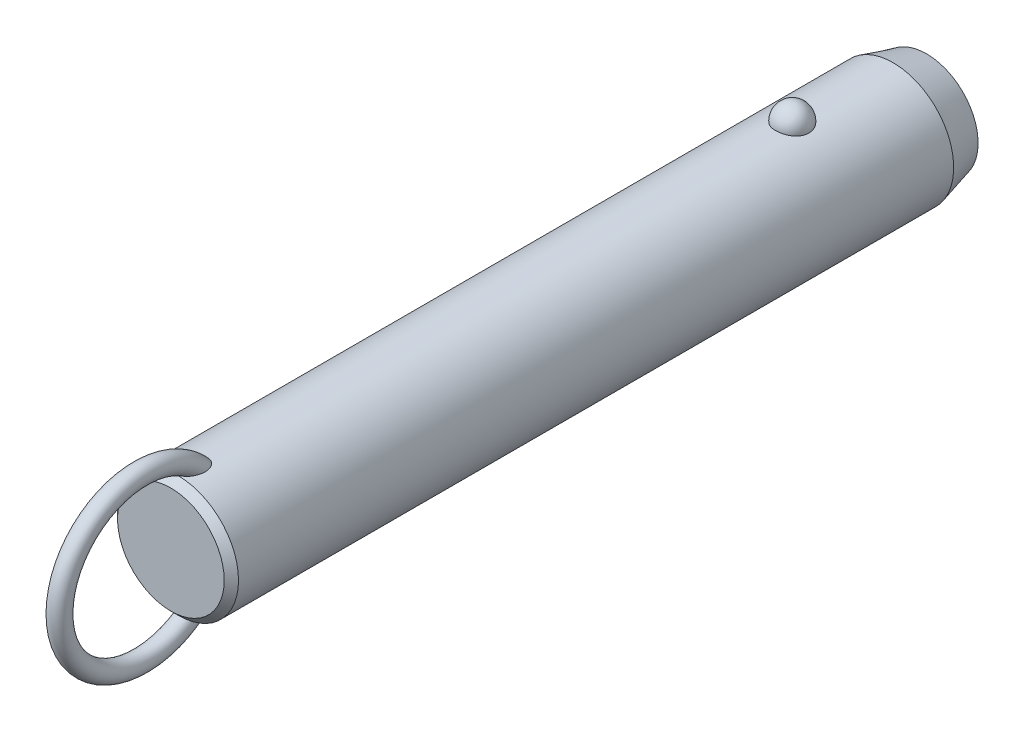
ISO-10303-21;
HEADER;
FILE_DESCRIPTION(('STEP AP214'),'2;1');
FILE_NAME('part.step','',(''),(''),'','','');
FILE_SCHEMA(('AUTOMOTIVE_DESIGN { 1 0 10303 214 1 1 1 1 }'));
ENDSEC;
DATA;
#1=APPLICATION_CONTEXT('core data for automotive mechanical design processes');
#2=APPLICATION_PROTOCOL_DEFINITION('international standard','automotive_design',2000,#1);
#3=PRODUCT_CONTEXT('',#1,'mechanical');
#4=PRODUCT('Part','Part','',(#3));
#5=PRODUCT_RELATED_PRODUCT_CATEGORY('part','',(#4));
#6=PRODUCT_DEFINITION_FORMATION('','',#4);
#7=PRODUCT_DEFINITION_CONTEXT('part definition',#1,'design');
#8=PRODUCT_DEFINITION('design','',#6,#7);
#9=PRODUCT_DEFINITION_SHAPE('','',#8);
#10=(LENGTH_UNIT() NAMED_UNIT(*) SI_UNIT(.MILLI.,.METRE.));
#11=(NAMED_UNIT(*) PLANE_ANGLE_UNIT() SI_UNIT($,.RADIAN.));
#12=(NAMED_UNIT(*) SI_UNIT($,.STERADIAN.) SOLID_ANGLE_UNIT());
#13=UNCERTAINTY_MEASURE_WITH_UNIT(LENGTH_MEASURE(1.E-05),#10,'distance_accuracy_value','');
#14=(GEOMETRIC_REPRESENTATION_CONTEXT(3) GLOBAL_UNCERTAINTY_ASSIGNED_CONTEXT((#13)) GLOBAL_UNIT_ASSIGNED_CONTEXT((#10,
#11,#12)) REPRESENTATION_CONTEXT('',''));
#15=CARTESIAN_POINT('',(0.,0.,0.));
#16=DIRECTION('',(0.,0.,1.));
#17=DIRECTION('',(1.,0.,0.));
#18=AXIS2_PLACEMENT_3D('',#15,#16,#17);
#19=CARTESIAN_POINT('',(0.,0.,114.3));
#20=DIRECTION('',(0.,0.,-1.));
#21=DIRECTION('',(-1.,0.,0.));
#22=AXIS2_PLACEMENT_3D('',#19,#20,#21);
#23=CYLINDRICAL_SURFACE('',#22,12.7);
#24=CARTESIAN_POINT('',(3.46661256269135,12.2177165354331,-3.5));
#25=CARTESIAN_POINT('',(3.4666090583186,12.2177194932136,-3.30432790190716));
#26=CARTESIAN_POINT('',(3.45063567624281,12.2222841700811,-3.10861112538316));
#27=CARTESIAN_POINT('',(3.38712451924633,12.2400345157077,-2.72271899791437));
#28=CARTESIAN_POINT('',(3.33957415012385,12.2532236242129,-2.53254588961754));
#29=CARTESIAN_POINT('',(3.2141234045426,12.286724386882,-2.16324948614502));
#30=CARTESIAN_POINT('',(3.13623639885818,12.3070329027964,-1.98412136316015));
#31=CARTESIAN_POINT('',(2.95205930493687,12.3525018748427,-1.64180592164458));
#32=CARTESIAN_POINT('',(2.84577003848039,12.3776621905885,-1.47861814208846));
#33=CARTESIAN_POINT('',(2.60688050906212,12.4301712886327,-1.17190583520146));
#34=CARTESIAN_POINT('',(2.47415697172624,12.4575299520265,-1.02847897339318));
#35=CARTESIAN_POINT('',(2.18615174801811,12.5112810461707,-0.766177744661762));
#36=CARTESIAN_POINT('',(2.03087002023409,12.5376734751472,-0.64730342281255));
#37=CARTESIAN_POINT('',(1.70237334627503,12.5864761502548,-0.437732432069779));
#38=CARTESIAN_POINT('',(1.52920948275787,12.6088972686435,-0.346958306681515));
#39=CARTESIAN_POINT('',(1.16944170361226,12.6473352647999,-0.195750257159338));
#40=CARTESIAN_POINT('',(0.982839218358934,12.663352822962,-0.135313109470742));
#41=CARTESIAN_POINT('',(0.604961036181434,12.6869706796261,-0.0473241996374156));
#42=CARTESIAN_POINT('',(0.41382314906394,12.6947125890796,-0.0192185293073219));
#43=CARTESIAN_POINT('',(0.0293827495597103,12.7014203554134,0.0051725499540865));
#44=CARTESIAN_POINT('',(-0.163919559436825,12.7003870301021,0.00146092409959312));
#45=CARTESIAN_POINT('',(-0.544374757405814,12.689735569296,-0.0373939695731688));
#46=CARTESIAN_POINT('',(-0.731575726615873,12.6802364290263,-0.0721015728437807));
#47=CARTESIAN_POINT('',(-1.09733277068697,12.6538333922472,-0.171364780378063));
#48=CARTESIAN_POINT('',(-1.27588869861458,12.6369293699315,-0.235920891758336));
#49=CARTESIAN_POINT('',(-1.6204698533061,12.5973946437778,-0.393548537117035));
#50=CARTESIAN_POINT('',(-1.78641865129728,12.5747321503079,-0.486778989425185));
#51=CARTESIAN_POINT('',(-2.10030671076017,12.5261316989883,-0.699110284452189));
#52=CARTESIAN_POINT('',(-2.24824419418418,12.5001934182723,-0.818213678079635));
#53=CARTESIAN_POINT('',(-2.52491489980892,12.4472906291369,-1.08157124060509));
#54=CARTESIAN_POINT('',(-2.65324222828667,12.4203160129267,-1.22624992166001));
#55=CARTESIAN_POINT('',(-2.88410007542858,12.3687509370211,-1.53528325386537));
#56=CARTESIAN_POINT('',(-2.98662883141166,12.3441606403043,-1.69963924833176));
#57=CARTESIAN_POINT('',(-3.16432417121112,12.2998199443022,-2.04548497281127));
#58=CARTESIAN_POINT('',(-3.23917525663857,12.2801261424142,-2.22714424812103));
#59=CARTESIAN_POINT('',(-3.35800573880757,12.248167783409,-2.6009138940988));
#60=CARTESIAN_POINT('',(-3.4019860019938,12.2359030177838,-2.79302397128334));
#61=CARTESIAN_POINT('',(-3.45784812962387,12.2202347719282,-3.18140279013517));
#62=CARTESIAN_POINT('',(-3.46986123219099,12.2167950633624,-3.37765118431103));
#63=CARTESIAN_POINT('',(-3.46186273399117,12.2190638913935,-3.76943689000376));
#64=CARTESIAN_POINT('',(-3.44185196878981,12.2247721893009,-3.96497421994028));
#65=CARTESIAN_POINT('',(-3.37048652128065,12.2446381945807,-4.34881728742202));
#66=CARTESIAN_POINT('',(-3.31928253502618,12.2587552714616,-4.53715319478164));
#67=CARTESIAN_POINT('',(-3.18693461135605,12.2938237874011,-4.90231727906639));
#68=CARTESIAN_POINT('',(-3.1057895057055,12.3147754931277,-5.07914500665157));
#69=CARTESIAN_POINT('',(-2.91506431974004,12.3613125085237,-5.41732059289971));
#70=CARTESIAN_POINT('',(-2.80533587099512,12.3869217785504,-5.57858147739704));
#71=CARTESIAN_POINT('',(-2.560414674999,12.4398525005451,-5.88013283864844));
#72=CARTESIAN_POINT('',(-2.42522099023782,12.4671740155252,-6.02042254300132));
#73=CARTESIAN_POINT('',(-2.1323357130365,12.5205965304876,-6.27662798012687));
#74=CARTESIAN_POINT('',(-1.97456596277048,12.5466928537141,-6.3924554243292));
#75=CARTESIAN_POINT('',(-1.64115839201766,12.5946384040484,-6.59583547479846));
#76=CARTESIAN_POINT('',(-1.46552179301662,12.6164879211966,-6.68339001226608));
#77=CARTESIAN_POINT('',(-1.10356050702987,12.6532533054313,-6.82682153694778));
#78=CARTESIAN_POINT('',(-0.9173913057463,12.6682500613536,-6.8830698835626));
#79=CARTESIAN_POINT('',(-0.537836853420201,12.6900288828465,-6.96386887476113));
#80=CARTESIAN_POINT('',(-0.344452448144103,12.6968119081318,-6.9884232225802));
#81=CARTESIAN_POINT('',(0.0402577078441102,12.7013667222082,-7.00496469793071));
#82=CARTESIAN_POINT('',(0.231556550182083,12.6993008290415,-6.99753844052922));
#83=CARTESIAN_POINT('',(0.610105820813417,12.6867505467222,-6.9516636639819));
#84=CARTESIAN_POINT('',(0.797356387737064,12.6762664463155,-6.913216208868));
#85=CARTESIAN_POINT('',(1.16186657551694,12.6480587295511,-6.80658431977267));
#86=CARTESIAN_POINT('',(1.33915951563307,12.6303611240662,-6.73850666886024));
#87=CARTESIAN_POINT('',(1.67968518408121,12.5896027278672,-6.5745087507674));
#88=CARTESIAN_POINT('',(1.84291705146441,12.5665416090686,-6.47858678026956));
#89=CARTESIAN_POINT('',(2.15340192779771,12.5171072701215,-6.25982455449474));
#90=CARTESIAN_POINT('',(2.30037831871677,12.4906895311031,-6.13660186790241));
#91=CARTESIAN_POINT('',(2.5717412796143,12.4376567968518,-5.86739587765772));
#92=CARTESIAN_POINT('',(2.69612388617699,12.4110417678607,-5.72140858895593));
#93=CARTESIAN_POINT('',(2.92107785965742,12.360051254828,-5.40794137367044));
#94=CARTESIAN_POINT('',(3.02121329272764,12.3357209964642,-5.24014110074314));
#95=CARTESIAN_POINT('',(3.19236291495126,12.2925446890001,-4.88969865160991));
#96=CARTESIAN_POINT('',(3.26338839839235,12.2736965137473,-4.70706226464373));
#97=CARTESIAN_POINT('',(3.36788038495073,12.245404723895,-4.35469510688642));
#98=CARTESIAN_POINT('',(3.40484026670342,12.2351018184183,-4.18605935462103));
#99=CARTESIAN_POINT('',(3.45420764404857,12.2212564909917,-3.84496058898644));
#100=CARTESIAN_POINT('',(3.46661565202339,12.2177139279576,-3.67249765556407));
#101=CARTESIAN_POINT('',(3.46661256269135,12.2177165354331,-3.5));
#102=B_SPLINE_CURVE_WITH_KNOTS('',3,(#24,#25,#26,#27,#28,#29,#30,#31,#32,#33,#34,#35,#36,#37,
#38,#39,#40,#41,#42,#43,#44,#45,#46,#47,#48,#49,#50,#51,#52,#53,#54,#55,#56,#57,#58,#59,#60,#61,
#62,#63,#64,#65,#66,#67,#68,#69,#70,#71,#72,#73,#74,#75,#76,#77,#78,#79,#80,#81,#82,#83,#84,#85,
#86,#87,#88,#89,#90,#91,#92,#93,#94,#95,#96,#97,#98,#99,#100,#101),.UNSPECIFIED.,.T.,.F.,(4,2,2,
2,2,2,2,2,2,2,2,2,2,2,2,2,2,2,2,2,2,2,2,2,2,2,2,2,2,2,2,2,2,2,2,2,2,2,4),(0.,0.586396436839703,
1.17302689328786,1.7593990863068,2.34575431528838,2.93491084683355,3.52406845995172,
4.11158733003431,4.69904375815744,5.2762784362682,5.85345931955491,6.42265312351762,
6.99185659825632,7.56427334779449,8.136746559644,8.71981013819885,9.3029135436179,
9.89247258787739,10.4820150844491,11.0691335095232,11.6562366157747,12.2405256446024,
12.8248374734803,13.412244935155,13.9996740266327,14.5891883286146,15.1786623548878,
15.7609861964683,16.3432419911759,16.9148635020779,17.4864654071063,18.0560241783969,
18.6256177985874,19.2037609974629,19.7820055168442,20.3699810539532,20.957728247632,
21.4746855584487,21.9916320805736),.UNSPECIFIED.);
#103=CARTESIAN_POINT('',(3.46661256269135,12.2177165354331,-3.5));
#104=VERTEX_POINT('',#103);
#105=EDGE_CURVE('E41',#104,#104,#102,.T.);
#106=ORIENTED_EDGE('',*,*,#105,.T.);
#107=EDGE_LOOP('',(#106));
#108=FACE_BOUND('',#107,.T.);
#109=CARTESIAN_POINT('',(0.,0.,125.5));
#110=DIRECTION('',(0.,0.,1.));
#111=DIRECTION('',(1.,0.,0.));
#112=AXIS2_PLACEMENT_3D('',#109,#110,#111);
#113=CIRCLE('',#112,12.7);
#114=CARTESIAN_POINT('',(12.7,0.,125.5));
#115=VERTEX_POINT('',#114);
#116=EDGE_CURVE('E10',#115,#115,#113,.F.);
#117=ORIENTED_EDGE('',*,*,#116,.T.);
#118=EDGE_LOOP('',(#117));
#119=FACE_BOUND('',#118,.T.);
#120=CARTESIAN_POINT('',(-0.548122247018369,-12.6881662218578,119.243218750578));
#121=CARTESIAN_POINT('',(-0.648865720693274,-12.6838128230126,119.277926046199));
#122=CARTESIAN_POINT('',(-0.746398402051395,-12.6783867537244,119.322042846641));
#123=CARTESIAN_POINT('',(-0.932125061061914,-12.666091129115,119.426764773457));
#124=CARTESIAN_POINT('',(-1.02030388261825,-12.6592192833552,119.487396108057));
#125=CARTESIAN_POINT('',(-1.18487740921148,-12.6448747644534,119.621847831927));
#126=CARTESIAN_POINT('',(-1.26134296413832,-12.637406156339,119.695582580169));
#127=CARTESIAN_POINT('',(-1.40231200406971,-12.6225412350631,119.853604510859));
#128=CARTESIAN_POINT('',(-1.46681470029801,-12.6151449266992,119.93789238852));
#129=CARTESIAN_POINT('',(-1.60714786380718,-12.5981718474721,120.149657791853));
#130=CARTESIAN_POINT('',(-1.67725126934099,-12.588900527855,120.280962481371));
#131=CARTESIAN_POINT('',(-1.79536591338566,-12.5725964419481,120.553247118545));
#132=CARTESIAN_POINT('',(-1.84333535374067,-12.5655679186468,120.694244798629));
#133=CARTESIAN_POINT('',(-1.93422576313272,-12.5519624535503,121.037645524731));
#134=CARTESIAN_POINT('',(-1.96788773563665,-12.5466298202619,121.242557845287));
#135=CARTESIAN_POINT('',(-1.9941399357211,-12.542463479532,121.551760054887));
#136=CARTESIAN_POINT('',(-1.99883864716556,-12.5417153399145,121.655298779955));
#137=CARTESIAN_POINT('',(-2.00078003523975,-12.5414074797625,121.86245124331));
#138=CARTESIAN_POINT('',(-1.99802449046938,-12.5418474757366,121.966064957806));
#139=CARTESIAN_POINT('',(-1.98336733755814,-12.5441750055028,122.210320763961));
#140=CARTESIAN_POINT('',(-1.96851430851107,-12.5465291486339,122.350780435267));
#141=CARTESIAN_POINT('',(-1.92707089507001,-12.5529612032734,122.629960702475));
#142=CARTESIAN_POINT('',(-1.90047458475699,-12.5570399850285,122.768680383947));
#143=CARTESIAN_POINT('',(-1.8361912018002,-12.5666008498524,123.04341135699));
#144=CARTESIAN_POINT('',(-1.79850828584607,-12.57208240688,123.179423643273));
#145=CARTESIAN_POINT('',(-1.71223796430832,-12.5841228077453,123.447842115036));
#146=CARTESIAN_POINT('',(-1.66365679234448,-12.5906810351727,123.580250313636));
#147=CARTESIAN_POINT('',(-1.5780450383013,-12.6016176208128,123.78548877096));
#148=CARTESIAN_POINT('',(-1.54477252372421,-12.6057501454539,123.859914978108));
#149=CARTESIAN_POINT('',(-1.47424480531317,-12.6141930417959,124.006839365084));
#150=CARTESIAN_POINT('',(-1.43699041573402,-12.6185033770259,124.079337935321));
#151=CARTESIAN_POINT('',(-1.35825795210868,-12.6272207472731,124.221892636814));
#152=CARTESIAN_POINT('',(-1.31678520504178,-12.6316276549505,124.291951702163));
#153=CARTESIAN_POINT('',(-1.22917793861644,-12.6404532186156,124.429070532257));
#154=CARTESIAN_POINT('',(-1.18304514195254,-12.6448718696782,124.496131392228));
#155=CARTESIAN_POINT('',(-1.07246411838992,-12.6547893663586,124.643874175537));
#156=CARTESIAN_POINT('',(-1.00642239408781,-12.6602600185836,124.723384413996));
#157=CARTESIAN_POINT('',(-0.864441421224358,-12.6707460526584,124.873169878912));
#158=CARTESIAN_POINT('',(-0.788516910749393,-12.6757620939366,124.943458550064));
#159=CARTESIAN_POINT('',(-0.652215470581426,-12.6833591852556,125.048680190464));
#160=CARTESIAN_POINT('',(-0.594982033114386,-12.6861973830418,125.087624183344));
#161=CARTESIAN_POINT('',(-0.475269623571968,-12.6912445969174,125.156489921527));
#162=CARTESIAN_POINT('',(-0.412800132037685,-12.6934547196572,125.186427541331));
#163=CARTESIAN_POINT('',(-0.295749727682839,-12.6966636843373,125.229756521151));
#164=CARTESIAN_POINT('',(-0.24194995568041,-12.6978134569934,125.245218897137));
#165=CARTESIAN_POINT('',(-0.132508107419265,-12.6994261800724,125.266884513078));
#166=CARTESIAN_POINT('',(-0.0768679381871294,-12.6998898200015,125.273097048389));
#167=CARTESIAN_POINT('',(0.0347696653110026,-12.7000752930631,125.275583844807));
#168=CARTESIAN_POINT('',(0.0907676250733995,-12.6997954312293,125.271835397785));
#169=CARTESIAN_POINT('',(0.201283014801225,-12.6985255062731,125.254788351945));
#170=CARTESIAN_POINT('',(0.255799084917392,-12.6975348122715,125.241481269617));
#171=CARTESIAN_POINT('',(0.37604233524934,-12.6946091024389,125.20203792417));
#172=CARTESIAN_POINT('',(0.440950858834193,-12.6924943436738,125.173449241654));
#173=CARTESIAN_POINT('',(0.565350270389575,-12.6875639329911,125.106323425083));
#174=CARTESIAN_POINT('',(0.624828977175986,-12.6847467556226,125.067764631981));
#175=CARTESIAN_POINT('',(0.774116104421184,-12.6767252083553,124.956949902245));
#176=CARTESIAN_POINT('',(0.859449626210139,-12.6711344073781,124.878760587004));
#177=CARTESIAN_POINT('',(1.01789440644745,-12.6593922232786,124.710943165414));
#178=CARTESIAN_POINT('',(1.09096902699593,-12.653239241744,124.621282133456));
#179=CARTESIAN_POINT('',(1.22268793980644,-12.6411674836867,124.440265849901));
#180=CARTESIAN_POINT('',(1.28193986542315,-12.6352572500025,124.349345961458));
#181=CARTESIAN_POINT('',(1.39259777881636,-12.6235401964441,124.162792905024));
#182=CARTESIAN_POINT('',(1.44399707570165,-12.6177334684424,124.067155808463));
#183=CARTESIAN_POINT('',(1.53972870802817,-12.6064093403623,123.872273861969));
#184=CARTESIAN_POINT('',(1.58405262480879,-12.6008922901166,123.773024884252));
#185=CARTESIAN_POINT('',(1.66600705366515,-12.5903187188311,123.571772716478));
#186=CARTESIAN_POINT('',(1.70363651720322,-12.5852622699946,123.469769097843));
#187=CARTESIAN_POINT('',(1.7754537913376,-12.5753406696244,123.254358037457));
#188=CARTESIAN_POINT('',(1.80903453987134,-12.5705328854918,123.140745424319));
#189=CARTESIAN_POINT('',(1.86844163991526,-12.5618400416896,122.911457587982));
#190=CARTESIAN_POINT('',(1.89426665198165,-12.5579551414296,122.795782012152));
#191=CARTESIAN_POINT('',(1.93785464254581,-12.5513030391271,122.563007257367));
#192=CARTESIAN_POINT('',(1.95562640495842,-12.5485346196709,122.445909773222));
#193=CARTESIAN_POINT('',(1.98264463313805,-12.5442934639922,122.210747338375));
#194=CARTESIAN_POINT('',(1.99189298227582,-12.5428204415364,122.09268260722));
#195=CARTESIAN_POINT('',(2.00416068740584,-12.540871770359,121.780622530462));
#196=CARTESIAN_POINT('',(1.99944433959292,-12.541631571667,121.586229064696));
#197=CARTESIAN_POINT('',(1.9611375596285,-12.5476846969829,121.200309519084));
#198=CARTESIAN_POINT('',(1.92758341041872,-12.5529723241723,121.008780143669));
#199=CARTESIAN_POINT('',(1.83934342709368,-12.5661532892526,120.682272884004));
#200=CARTESIAN_POINT('',(1.79215440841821,-12.5730485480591,120.54524997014));
#201=CARTESIAN_POINT('',(1.67676242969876,-12.588958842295,120.280445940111));
#202=CARTESIAN_POINT('',(1.60859050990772,-12.597970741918,120.152651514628));
#203=CARTESIAN_POINT('',(1.46583832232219,-12.6152829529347,119.935800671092));
#204=CARTESIAN_POINT('',(1.39525727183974,-12.6233659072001,119.84410500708));
#205=CARTESIAN_POINT('',(1.23992594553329,-12.6395676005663,119.673485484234));
#206=CARTESIAN_POINT('',(1.15517932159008,-12.6476863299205,119.594558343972));
#207=CARTESIAN_POINT('',(0.971995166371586,-12.6630846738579,119.452643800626));
#208=CARTESIAN_POINT('',(0.873456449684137,-12.6703572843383,119.389784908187));
#209=CARTESIAN_POINT('',(0.665847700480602,-12.6829569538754,119.284487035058));
#210=CARTESIAN_POINT('',(0.556784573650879,-12.688285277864,119.242034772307));
#211=CARTESIAN_POINT('',(0.347338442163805,-12.6956226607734,119.184443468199));
#212=CARTESIAN_POINT('',(0.247759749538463,-12.6979816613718,119.166399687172));
#213=CARTESIAN_POINT('',(0.0470218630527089,-12.7003077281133,119.148600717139));
#214=CARTESIAN_POINT('',(-0.0541350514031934,-12.7002779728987,119.148821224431));
#215=CARTESIAN_POINT('',(-0.221414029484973,-12.6982482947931,119.164363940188));
#216=CARTESIAN_POINT('',(-0.288055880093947,-12.6969033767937,119.174666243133));
#217=CARTESIAN_POINT('',(-0.4195992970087,-12.6932369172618,119.20313489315));
#218=CARTESIAN_POINT('',(-0.48450102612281,-12.6909154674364,119.221300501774));
#219=CARTESIAN_POINT('',(-0.548122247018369,-12.6881662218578,119.243218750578));
#220=B_SPLINE_CURVE_WITH_KNOTS('',3,(#120,#121,#122,#123,#124,#125,#126,#127,#128,#129,#130,
#131,#132,#133,#134,#135,#136,#137,#138,#139,#140,#141,#142,#143,#144,#145,#146,#147,#148,#149,
#150,#151,#152,#153,#154,#155,#156,#157,#158,#159,#160,#161,#162,#163,#164,#165,#166,#167,#168,
#169,#170,#171,#172,#173,#174,#175,#176,#177,#178,#179,#180,#181,#182,#183,#184,#185,#186,#187,
#188,#189,#190,#191,#192,#193,#194,#195,#196,#197,#198,#199,#200,#201,#202,#203,#204,#205,#206,
#207,#208,#209,#210,#211,#212,#213,#214,#215,#216,#217,#218,#219),.UNSPECIFIED.,.T.,.F.,(4,2,2,
2,2,2,2,2,2,2,2,2,2,2,2,2,2,2,2,2,2,2,2,2,2,2,2,2,2,2,2,2,2,2,2,2,2,2,2,2,2,2,2,2,2,2,2,2,2,4),
(0.,0.319642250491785,0.639794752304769,0.957927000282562,1.27608021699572,1.72100165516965,
2.16675988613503,2.78630021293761,3.09705782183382,3.40774128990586,3.83096358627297,
4.25439969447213,4.67767724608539,5.10071330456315,5.34550297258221,5.59024267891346,
5.83467707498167,6.079021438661,6.38891080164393,6.69834321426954,6.90560910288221,
7.11250749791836,7.27977315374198,7.44687060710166,7.6143493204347,7.78197685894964,
7.99365544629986,8.20579780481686,8.55147335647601,8.89816429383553,9.22375138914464,
9.54961437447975,9.87586224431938,10.202161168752,10.5575872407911,10.9130746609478,
11.2681734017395,11.6231936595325,12.2046601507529,12.7853961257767,13.2191642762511,
13.6522938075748,13.9989174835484,14.3454519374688,14.6946768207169,15.0436740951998,
15.3457513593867,15.647426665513,15.8493051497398,16.0511646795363),.UNSPECIFIED.);
#221=CARTESIAN_POINT('',(-0.548122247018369,-12.6881662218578,119.243218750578));
#222=VERTEX_POINT('',#221);
#223=EDGE_CURVE('E60',#222,#222,#220,.T.);
#224=ORIENTED_EDGE('',*,*,#223,.T.);
#225=EDGE_LOOP('',(#224));
#226=FACE_BOUND('',#225,.T.);
#227=CARTESIAN_POINT('',(-0.548122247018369,12.6881662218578,119.243218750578));
#228=CARTESIAN_POINT('',(-0.459436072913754,12.6919968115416,119.212673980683));
#229=CARTESIAN_POINT('',(-0.368189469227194,12.6949996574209,119.189391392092));
#230=CARTESIAN_POINT('',(-0.183024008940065,12.6990186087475,119.158406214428));
#231=CARTESIAN_POINT('',(-0.089104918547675,12.7000345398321,119.150704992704));
#232=CARTESIAN_POINT('',(0.0987147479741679,12.6999636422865,119.151245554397));
#233=CARTESIAN_POINT('',(0.192615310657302,12.6988761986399,119.159492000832));
#234=CARTESIAN_POINT('',(0.377658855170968,12.6947211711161,119.191551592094));
#235=CARTESIAN_POINT('',(0.468801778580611,12.6916535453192,119.215365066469));
#236=CARTESIAN_POINT('',(0.645809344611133,12.6838788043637,119.27745651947));
#237=CARTESIAN_POINT('',(0.731679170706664,12.6791733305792,119.315720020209));
#238=CARTESIAN_POINT('',(0.896315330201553,12.6686004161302,119.405120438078));
#239=CARTESIAN_POINT('',(0.975080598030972,12.6627328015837,119.456259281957));
#240=CARTESIAN_POINT('',(1.12963655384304,12.6499161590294,119.57367820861));
#241=CARTESIAN_POINT('',(1.20478673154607,12.6429194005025,119.640792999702));
#242=CARTESIAN_POINT('',(1.34448241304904,12.6288282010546,119.78522507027));
#243=CARTESIAN_POINT('',(1.40902173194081,12.621733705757,119.862548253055));
#244=CARTESIAN_POINT('',(1.55208211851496,12.6050877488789,120.059247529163));
#245=CARTESIAN_POINT('',(1.62510490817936,12.5957546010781,120.182654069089));
#246=CARTESIAN_POINT('',(1.75019044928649,12.5789823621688,120.439769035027));
#247=CARTESIAN_POINT('',(1.80221377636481,12.5715468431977,120.573496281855));
#248=CARTESIAN_POINT('',(1.90309965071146,12.5567434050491,120.898351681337));
#249=CARTESIAN_POINT('',(1.94342317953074,12.5504515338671,121.092161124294));
#250=CARTESIAN_POINT('',(1.99332997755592,12.5426147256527,121.48378810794));
#251=CARTESIAN_POINT('',(2.00285305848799,12.5410790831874,121.681612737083));
#252=CARTESIAN_POINT('',(1.99678999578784,12.5420407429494,122.016642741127));
#253=CARTESIAN_POINT('',(1.98794117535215,12.5434564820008,122.154042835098));
#254=CARTESIAN_POINT('',(1.95865119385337,12.5480641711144,122.427639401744));
#255=CARTESIAN_POINT('',(1.93820436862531,12.5512569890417,122.563835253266));
#256=CARTESIAN_POINT('',(1.88647896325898,12.5591352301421,122.834249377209));
#257=CARTESIAN_POINT('',(1.85518800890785,12.5638223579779,122.96846520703));
#258=CARTESIAN_POINT('',(1.78217886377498,12.5743868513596,123.233936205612));
#259=CARTESIAN_POINT('',(1.74046509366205,12.5802637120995,123.365192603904));
#260=CARTESIAN_POINT('',(1.66024095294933,12.5910571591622,123.586085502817));
#261=CARTESIAN_POINT('',(1.62434772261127,12.5957535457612,123.676690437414));
#262=CARTESIAN_POINT('',(1.5470900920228,12.6054762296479,123.855512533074));
#263=CARTESIAN_POINT('',(1.50572681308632,12.6105024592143,123.943730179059));
#264=CARTESIAN_POINT('',(1.41728020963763,12.620748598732,124.116932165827));
#265=CARTESIAN_POINT('',(1.37021377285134,12.625967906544,124.201925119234));
#266=CARTESIAN_POINT('',(1.26969620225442,12.6364721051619,124.368007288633));
#267=CARTESIAN_POINT('',(1.21624929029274,12.6417569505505,124.449099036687));
#268=CARTESIAN_POINT('',(1.10304413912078,12.6521331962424,124.604702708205));
#269=CARTESIAN_POINT('',(1.04340936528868,12.657226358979,124.679303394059));
#270=CARTESIAN_POINT('',(0.915919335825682,12.6670906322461,124.821324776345));
#271=CARTESIAN_POINT('',(0.848064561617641,12.6718617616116,124.888745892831));
#272=CARTESIAN_POINT('',(0.71703570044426,12.67987711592,125.000624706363));
#273=CARTESIAN_POINT('',(0.655526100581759,12.6832377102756,125.046997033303));
#274=CARTESIAN_POINT('',(0.525985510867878,12.6892676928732,125.129619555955));
#275=CARTESIAN_POINT('',(0.457969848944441,12.6919386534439,125.165892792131));
#276=CARTESIAN_POINT('',(0.334859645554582,12.695691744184,125.216657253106));
#277=CARTESIAN_POINT('',(0.281116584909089,12.6970073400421,125.234373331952));
#278=CARTESIAN_POINT('',(0.171425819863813,12.6989609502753,125.260642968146));
#279=CARTESIAN_POINT('',(0.11548082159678,12.699599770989,125.269207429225));
#280=CARTESIAN_POINT('',(0.00272618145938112,12.7001251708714,125.276253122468));
#281=CARTESIAN_POINT('',(-0.0540859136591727,12.7000089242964,125.274696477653));
#282=CARTESIAN_POINT('',(-0.166544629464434,12.6990328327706,125.261600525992));
#283=CARTESIAN_POINT('',(-0.222190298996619,12.6981724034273,125.250053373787));
#284=CARTESIAN_POINT('',(-0.342018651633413,12.695562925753,125.214912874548));
#285=CARTESIAN_POINT('',(-0.405606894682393,12.6936676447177,125.18933225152));
#286=CARTESIAN_POINT('',(-0.52781549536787,12.6891754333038,125.128311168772));
#287=CARTESIAN_POINT('',(-0.586425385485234,12.6865770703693,125.092850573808));
#288=CARTESIAN_POINT('',(-0.731842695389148,12.6792129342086,124.991496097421));
#289=CARTESIAN_POINT('',(-0.814709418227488,12.6740767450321,124.9200395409));
#290=CARTESIAN_POINT('',(-0.969101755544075,12.6632083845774,124.76589007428));
#291=CARTESIAN_POINT('',(-1.04059564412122,12.6574746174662,124.683166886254));
#292=CARTESIAN_POINT('',(-1.16981116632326,12.6461638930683,124.515809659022));
#293=CARTESIAN_POINT('',(-1.22811369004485,12.6405994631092,124.431616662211));
#294=CARTESIAN_POINT('',(-1.33743405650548,12.6295007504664,124.258579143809));
#295=CARTESIAN_POINT('',(-1.38844577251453,12.6239664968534,124.169730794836));
#296=CARTESIAN_POINT('',(-1.48400702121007,12.6130898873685,123.988389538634));
#297=CARTESIAN_POINT('',(-1.52854232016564,12.6077479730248,123.895889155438));
#298=CARTESIAN_POINT('',(-1.61150113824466,12.5974127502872,123.708160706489));
#299=CARTESIAN_POINT('',(-1.64992317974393,12.5924195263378,123.612931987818));
#300=CARTESIAN_POINT('',(-1.73468589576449,12.581070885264,123.38289362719));
#301=CARTESIAN_POINT('',(-1.77831261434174,12.5749388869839,123.247066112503));
#302=CARTESIAN_POINT('',(-1.85439734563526,12.5639437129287,122.972212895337));
#303=CARTESIAN_POINT('',(-1.88684994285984,12.5590811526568,122.833185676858));
#304=CARTESIAN_POINT('',(-1.94008483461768,12.550968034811,122.55309235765));
#305=CARTESIAN_POINT('',(-1.96088706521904,12.5477147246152,122.412030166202));
#306=CARTESIAN_POINT('',(-1.99000539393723,12.5431291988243,122.128668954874));
#307=CARTESIAN_POINT('',(-1.99832911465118,12.5417958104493,121.986370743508));
#308=CARTESIAN_POINT('',(-2.00166624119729,12.5412674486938,121.657627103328));
#309=CARTESIAN_POINT('',(-1.99178843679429,12.5428579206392,121.471088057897));
#310=CARTESIAN_POINT('',(-1.94455183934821,12.5502731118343,121.10162404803));
#311=CARTESIAN_POINT('',(-1.9072403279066,12.5560905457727,120.918693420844));
#312=CARTESIAN_POINT('',(-1.81330718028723,12.5699462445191,120.604848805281));
#313=CARTESIAN_POINT('',(-1.76338820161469,12.5771273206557,120.471910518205));
#314=CARTESIAN_POINT('',(-1.64305018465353,12.593414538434,120.215681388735));
#315=CARTESIAN_POINT('',(-1.57265346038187,12.6025185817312,120.092380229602));
#316=CARTESIAN_POINT('',(-1.4263495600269,12.6198178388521,119.883564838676));
#317=CARTESIAN_POINT('',(-1.35423772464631,12.6278405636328,119.795384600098));
#318=CARTESIAN_POINT('',(-1.19645664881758,12.6437632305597,119.632107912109));
#319=CARTESIAN_POINT('',(-1.1108053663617,12.6516633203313,119.556994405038));
#320=CARTESIAN_POINT('',(-0.947219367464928,12.6648319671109,119.437811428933));
#321=CARTESIAN_POINT('',(-0.871624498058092,12.670300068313,119.390541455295));
#322=CARTESIAN_POINT('',(-0.7141618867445,12.6801492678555,119.3077413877));
#323=CARTESIAN_POINT('',(-0.632295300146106,12.684530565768,119.27220913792));
#324=CARTESIAN_POINT('',(-0.548122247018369,12.6881662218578,119.243218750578));
#325=B_SPLINE_CURVE_WITH_KNOTS('',3,(#227,#228,#229,#230,#231,#232,#233,#234,#235,#236,#237,
#238,#239,#240,#241,#242,#243,#244,#245,#246,#247,#248,#249,#250,#251,#252,#253,#254,#255,#256,
#257,#258,#259,#260,#261,#262,#263,#264,#265,#266,#267,#268,#269,#270,#271,#272,#273,#274,#275,
#276,#277,#278,#279,#280,#281,#282,#283,#284,#285,#286,#287,#288,#289,#290,#291,#292,#293,#294,
#295,#296,#297,#298,#299,#300,#301,#302,#303,#304,#305,#306,#307,#308,#309,#310,#311,#312,#313,
#314,#315,#316,#317,#318,#319,#320,#321,#322,#323,#324),.UNSPECIFIED.,.T.,.F.,(4,2,2,2,2,2,2,2,
2,2,2,2,2,2,2,2,2,2,2,2,2,2,2,2,2,2,2,2,2,2,2,2,2,2,2,2,2,2,2,2,2,2,2,2,2,2,2,2,4),(0.,
0.281328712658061,0.562682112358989,0.844117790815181,1.12555942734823,1.40671982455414,
1.68792232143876,1.98972294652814,2.2916988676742,2.72039860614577,3.14989948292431,
3.7408491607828,4.33295293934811,4.74554109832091,5.15833092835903,5.57159335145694,
5.98468079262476,6.2772277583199,6.5697148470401,6.86135609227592,7.15280542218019,
7.43927407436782,7.7257259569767,7.95635862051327,8.18646071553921,8.35559393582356,
8.52452541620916,8.69408946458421,8.86378678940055,9.06834348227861,9.27332014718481,
9.60010414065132,9.92778432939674,10.2350252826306,10.5425229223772,10.8506864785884,
11.15892440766,11.5867893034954,12.0148612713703,12.4421984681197,12.8692745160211,
13.4279365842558,13.9856380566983,14.4107062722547,14.8353130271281,15.1765567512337,
15.5173516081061,15.7844129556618,16.051425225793),.UNSPECIFIED.);
#326=CARTESIAN_POINT('',(-0.548122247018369,12.6881662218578,119.243218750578));
#327=VERTEX_POINT('',#326);
#328=EDGE_CURVE('E67',#327,#327,#325,.T.);
#329=ORIENTED_EDGE('',*,*,#328,.T.);
#330=EDGE_LOOP('',(#329));
#331=FACE_BOUND('',#330,.T.);
#332=CARTESIAN_POINT('',(0.,0.,-24.6999999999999));
#333=DIRECTION('',(0.,0.,-1.));
#334=DIRECTION('',(-1.,0.,0.));
#335=AXIS2_PLACEMENT_3D('',#332,#333,#334);
#336=CIRCLE('',#335,12.7);
#337=CARTESIAN_POINT('',(-12.7,0.,-24.6999999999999));
#338=VERTEX_POINT('',#337);
#339=EDGE_CURVE('E57',#338,#338,#336,.F.);
#340=ORIENTED_EDGE('',*,*,#339,.T.);
#341=EDGE_LOOP('',(#340));
#342=FACE_BOUND('',#341,.T.);
#343=ADVANCED_FACE('F37',(#108,#119,#226,#331,#342),#23,.T.);
#344=CARTESIAN_POINT('',(0.,0.,-31.7));
#345=DIRECTION('',(0.,0.,-1.));
#346=DIRECTION('',(-1.,0.,0.));
#347=AXIS2_PLACEMENT_3D('',#344,#345,#346);
#348=PLANE('',#347);
#349=CARTESIAN_POINT('',(0.,0.,-31.7));
#350=DIRECTION('',(0.,0.,-1.));
#351=DIRECTION('',(-1.,0.,0.));
#352=AXIS2_PLACEMENT_3D('',#349,#350,#351);
#353=CIRCLE('',#352,10.8243556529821);
#354=CARTESIAN_POINT('',(-10.8243556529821,0.,-31.7));
#355=VERTEX_POINT('',#354);
#356=EDGE_CURVE('E66',#355,#355,#353,.T.);
#357=ORIENTED_EDGE('',*,*,#356,.T.);
#358=EDGE_LOOP('',(#357));
#359=FACE_BOUND('',#358,.T.);
#360=ADVANCED_FACE('F85',(#359),#348,.T.);
#361=CARTESIAN_POINT('',(0.,0.,-31.7));
#362=DIRECTION('',(0.,0.,1.));
#363=DIRECTION('',(1.,0.,0.));
#364=AXIS2_PLACEMENT_3D('',#361,#362,#363);
#365=CONICAL_SURFACE('',#364,10.8243556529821,0.261799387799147);
#366=ORIENTED_EDGE('',*,*,#339,.F.);
#367=EDGE_LOOP('',(#366));
#368=FACE_BOUND('',#367,.T.);
#369=ORIENTED_EDGE('',*,*,#356,.F.);
#370=EDGE_LOOP('',(#369));
#371=FACE_BOUND('',#370,.T.);
#372=ADVANCED_FACE('F83',(#368,#371),#365,.T.);
#373=CARTESIAN_POINT('',(0.,0.,127.));
#374=DIRECTION('',(0.,0.,1.));
#375=DIRECTION('',(1.,0.,0.));
#376=AXIS2_PLACEMENT_3D('',#373,#374,#375);
#377=PLANE('',#376);
#378=CARTESIAN_POINT('',(0.,0.,127.));
#379=DIRECTION('',(0.,0.,1.));
#380=DIRECTION('',(1.,0.,0.));
#381=AXIS2_PLACEMENT_3D('',#378,#379,#380);
#382=CIRCLE('',#381,11.2);
#383=CARTESIAN_POINT('',(11.2,0.,127.));
#384=VERTEX_POINT('',#383);
#385=EDGE_CURVE('E50',#384,#384,#382,.T.);
#386=ORIENTED_EDGE('',*,*,#385,.T.);
#387=EDGE_LOOP('',(#386));
#388=FACE_BOUND('',#387,.T.);
#389=ADVANCED_FACE('F77',(#388),#377,.T.);
#390=CARTESIAN_POINT('',(0.,0.,133.35));
#391=DIRECTION('',(1.,0.,0.));
#392=DIRECTION('',(0.,0.,-1.));
#393=AXIS2_PLACEMENT_3D('',#390,#391,#392);
#394=TOROIDAL_SURFACE('',#393,17.05,2.);
#395=ORIENTED_EDGE('',*,*,#328,.F.);
#396=EDGE_LOOP('',(#395));
#397=FACE_BOUND('',#396,.T.);
#398=ORIENTED_EDGE('',*,*,#223,.F.);
#399=EDGE_LOOP('',(#398));
#400=FACE_BOUND('',#399,.T.);
#401=ADVANCED_FACE('F73',(#397,#400),#394,.T.);
#402=CARTESIAN_POINT('',(0.,0.,127.));
#403=DIRECTION('',(0.,0.,-1.));
#404=DIRECTION('',(-1.,0.,0.));
#405=AXIS2_PLACEMENT_3D('',#402,#403,#404);
#406=CONICAL_SURFACE('',#405,11.2,0.785398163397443);
#407=ORIENTED_EDGE('',*,*,#116,.F.);
#408=EDGE_LOOP('',(#407));
#409=FACE_BOUND('',#408,.T.);
#410=ORIENTED_EDGE('',*,*,#385,.F.);
#411=EDGE_LOOP('',(#410));
#412=FACE_BOUND('',#411,.T.);
#413=ADVANCED_FACE('F39',(#409,#412),#406,.T.);
#414=CARTESIAN_POINT('',(0.,12.7,-3.5));
#415=DIRECTION('',(0.,1.,0.));
#416=DIRECTION('',(0.,0.,-1.));
#417=AXIS2_PLACEMENT_3D('',#414,#415,#416);
#418=SPHERICAL_SURFACE('',#417,3.5);
#419=ORIENTED_EDGE('',*,*,#105,.F.);
#420=EDGE_LOOP('',(#419));
#421=FACE_BOUND('',#420,.T.);
#422=ADVANCED_FACE('F79',(#421),#418,.T.);
#423=CLOSED_SHELL('',(#343,#360,#372,#389,#401,#413,#422));
#424=MANIFOLD_SOLID_BREP('B2',#423);
#425=ADVANCED_BREP_SHAPE_REPRESENTATION('',(#18,#424),#14);
#426=SHAPE_DEFINITION_REPRESENTATION(#9,#425);
ENDSEC;
END-ISO-10303-21;
